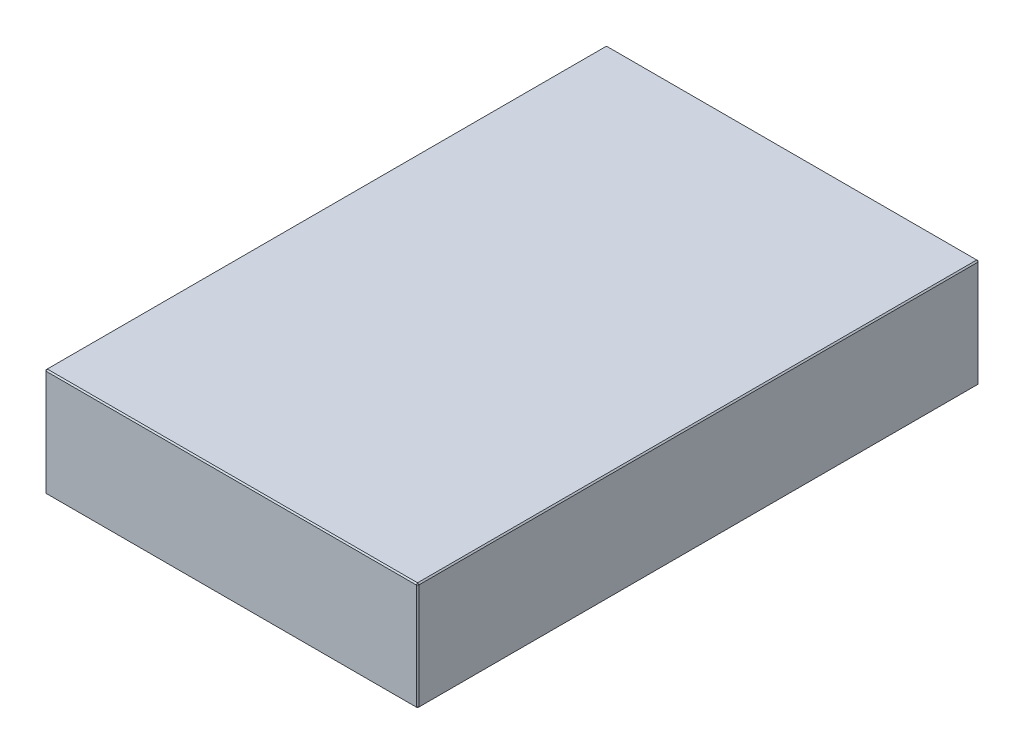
ISO-10303-21;
HEADER;
FILE_DESCRIPTION(('STEP AP214'),'2;1');
FILE_NAME('part.step','',(''),(''),'','','');
FILE_SCHEMA(('AUTOMOTIVE_DESIGN { 1 0 10303 214 1 1 1 1 }'));
ENDSEC;
DATA;
#1=APPLICATION_CONTEXT('core data for automotive mechanical design processes');
#2=APPLICATION_PROTOCOL_DEFINITION('international standard','automotive_design',2000,#1);
#3=PRODUCT_CONTEXT('',#1,'mechanical');
#4=PRODUCT('Part','Part','',(#3));
#5=PRODUCT_RELATED_PRODUCT_CATEGORY('part','',(#4));
#6=PRODUCT_DEFINITION_FORMATION('','',#4);
#7=PRODUCT_DEFINITION_CONTEXT('part definition',#1,'design');
#8=PRODUCT_DEFINITION('design','',#6,#7);
#9=PRODUCT_DEFINITION_SHAPE('','',#8);
#10=(LENGTH_UNIT() NAMED_UNIT(*) SI_UNIT(.MILLI.,.METRE.));
#11=(NAMED_UNIT(*) PLANE_ANGLE_UNIT() SI_UNIT($,.RADIAN.));
#12=(NAMED_UNIT(*) SI_UNIT($,.STERADIAN.) SOLID_ANGLE_UNIT());
#13=UNCERTAINTY_MEASURE_WITH_UNIT(LENGTH_MEASURE(1.E-05),#10,'distance_accuracy_value','');
#14=(GEOMETRIC_REPRESENTATION_CONTEXT(3) GLOBAL_UNCERTAINTY_ASSIGNED_CONTEXT((#13)) GLOBAL_UNIT_ASSIGNED_CONTEXT((#10,
#11,#12)) REPRESENTATION_CONTEXT('',''));
#15=CARTESIAN_POINT('',(0.,0.,0.));
#16=DIRECTION('',(0.,0.,1.));
#17=DIRECTION('',(1.,0.,0.));
#18=AXIS2_PLACEMENT_3D('',#15,#16,#17);
#19=CARTESIAN_POINT('',(-148.,86.,223.));
#20=DIRECTION('',(1.,0.,0.));
#21=DIRECTION('',(0.,0.,-1.));
#22=AXIS2_PLACEMENT_3D('',#19,#20,#21);
#23=PLANE('',#22);
#24=DIRECTION('',(0.,-1.,0.));
#25=VECTOR('',#24,1.);
#26=CARTESIAN_POINT('',(-148.,86.,-222.));
#27=LINE('',#26,#25);
#28=CARTESIAN_POINT('',(-148.,85.,-222.));
#29=VERTEX_POINT('',#28);
#30=CARTESIAN_POINT('',(-148.,1.,-222.));
#31=VERTEX_POINT('',#30);
#32=EDGE_CURVE('E114',#29,#31,#27,.T.);
#33=ORIENTED_EDGE('',*,*,#32,.T.);
#34=DIRECTION('',(0.,0.,1.));
#35=VECTOR('',#34,1.);
#36=CARTESIAN_POINT('',(-148.,1.,223.));
#37=LINE('',#36,#35);
#38=CARTESIAN_POINT('',(-148.,1.,222.));
#39=VERTEX_POINT('',#38);
#40=EDGE_CURVE('E110',#31,#39,#37,.T.);
#41=ORIENTED_EDGE('',*,*,#40,.T.);
#42=DIRECTION('',(0.,1.,0.));
#43=VECTOR('',#42,1.);
#44=CARTESIAN_POINT('',(-148.,86.,222.));
#45=LINE('',#44,#43);
#46=CARTESIAN_POINT('',(-148.,85.,222.));
#47=VERTEX_POINT('',#46);
#48=EDGE_CURVE('E103',#39,#47,#45,.T.);
#49=ORIENTED_EDGE('',*,*,#48,.T.);
#50=DIRECTION('',(0.,0.,-1.));
#51=VECTOR('',#50,1.);
#52=CARTESIAN_POINT('',(-148.,85.,-223.));
#53=LINE('',#52,#51);
#54=EDGE_CURVE('E107',#47,#29,#53,.T.);
#55=ORIENTED_EDGE('',*,*,#54,.T.);
#56=EDGE_LOOP('',(#33,#41,#49,#55));
#57=FACE_BOUND('',#56,.T.);
#58=ADVANCED_FACE('F15',(#57),#23,.F.);
#59=CARTESIAN_POINT('',(148.,86.,223.));
#60=DIRECTION('',(0.,0.,-1.));
#61=DIRECTION('',(-1.,0.,0.));
#62=AXIS2_PLACEMENT_3D('',#59,#60,#61);
#63=PLANE('',#62);
#64=DIRECTION('',(-1.,0.,0.));
#65=VECTOR('',#64,1.);
#66=CARTESIAN_POINT('',(-148.,85.,223.));
#67=LINE('',#66,#65);
#68=CARTESIAN_POINT('',(147.,85.,223.));
#69=VERTEX_POINT('',#68);
#70=CARTESIAN_POINT('',(-147.,85.,223.));
#71=VERTEX_POINT('',#70);
#72=EDGE_CURVE('E164',#69,#71,#67,.T.);
#73=ORIENTED_EDGE('',*,*,#72,.T.);
#74=DIRECTION('',(0.,-1.,0.));
#75=VECTOR('',#74,1.);
#76=CARTESIAN_POINT('',(-147.,86.,223.));
#77=LINE('',#76,#75);
#78=CARTESIAN_POINT('',(-147.,1.,223.));
#79=VERTEX_POINT('',#78);
#80=EDGE_CURVE('E122',#71,#79,#77,.T.);
#81=ORIENTED_EDGE('',*,*,#80,.T.);
#82=DIRECTION('',(1.,0.,0.));
#83=VECTOR('',#82,1.);
#84=CARTESIAN_POINT('',(148.,1.,223.));
#85=LINE('',#84,#83);
#86=CARTESIAN_POINT('',(147.,1.,223.));
#87=VERTEX_POINT('',#86);
#88=EDGE_CURVE('E168',#79,#87,#85,.T.);
#89=ORIENTED_EDGE('',*,*,#88,.T.);
#90=DIRECTION('',(0.,1.,0.));
#91=VECTOR('',#90,1.);
#92=CARTESIAN_POINT('',(147.,86.,223.));
#93=LINE('',#92,#91);
#94=EDGE_CURVE('E166',#87,#69,#93,.T.);
#95=ORIENTED_EDGE('',*,*,#94,.T.);
#96=EDGE_LOOP('',(#73,#81,#89,#95));
#97=FACE_BOUND('',#96,.T.);
#98=ADVANCED_FACE('F275',(#97),#63,.F.);
#99=CARTESIAN_POINT('',(148.,86.,223.));
#100=DIRECTION('',(-1.,0.,0.));
#101=DIRECTION('',(0.,0.,1.));
#102=AXIS2_PLACEMENT_3D('',#99,#100,#101);
#103=PLANE('',#102);
#104=DIRECTION('',(0.,0.,-1.));
#105=VECTOR('',#104,1.);
#106=CARTESIAN_POINT('',(148.,1.,223.));
#107=LINE('',#106,#105);
#108=CARTESIAN_POINT('',(148.,1.,222.));
#109=VERTEX_POINT('',#108);
#110=CARTESIAN_POINT('',(148.,1.,-222.));
#111=VERTEX_POINT('',#110);
#112=EDGE_CURVE('E159',#109,#111,#107,.T.);
#113=ORIENTED_EDGE('',*,*,#112,.T.);
#114=DIRECTION('',(0.,1.,0.));
#115=VECTOR('',#114,1.);
#116=CARTESIAN_POINT('',(148.,86.,-222.));
#117=LINE('',#116,#115);
#118=CARTESIAN_POINT('',(148.,85.,-222.));
#119=VERTEX_POINT('',#118);
#120=EDGE_CURVE('E161',#111,#119,#117,.T.);
#121=ORIENTED_EDGE('',*,*,#120,.T.);
#122=DIRECTION('',(0.,0.,1.));
#123=VECTOR('',#122,1.);
#124=CARTESIAN_POINT('',(148.,85.,223.));
#125=LINE('',#124,#123);
#126=CARTESIAN_POINT('',(148.,85.,222.));
#127=VERTEX_POINT('',#126);
#128=EDGE_CURVE('E155',#119,#127,#125,.T.);
#129=ORIENTED_EDGE('',*,*,#128,.T.);
#130=DIRECTION('',(0.,-1.,0.));
#131=VECTOR('',#130,1.);
#132=CARTESIAN_POINT('',(148.,86.,222.));
#133=LINE('',#132,#131);
#134=EDGE_CURVE('E157',#127,#109,#133,.T.);
#135=ORIENTED_EDGE('',*,*,#134,.T.);
#136=EDGE_LOOP('',(#113,#121,#129,#135));
#137=FACE_BOUND('',#136,.T.);
#138=ADVANCED_FACE('F254',(#137),#103,.F.);
#139=CARTESIAN_POINT('',(148.,86.,-223.));
#140=DIRECTION('',(0.,0.,1.));
#141=DIRECTION('',(1.,0.,0.));
#142=AXIS2_PLACEMENT_3D('',#139,#140,#141);
#143=PLANE('',#142);
#144=DIRECTION('',(0.,-1.,0.));
#145=VECTOR('',#144,1.);
#146=CARTESIAN_POINT('',(147.,86.,-223.));
#147=LINE('',#146,#145);
#148=CARTESIAN_POINT('',(147.,85.,-223.));
#149=VERTEX_POINT('',#148);
#150=CARTESIAN_POINT('',(147.,1.,-223.));
#151=VERTEX_POINT('',#150);
#152=EDGE_CURVE('E148',#149,#151,#147,.T.);
#153=ORIENTED_EDGE('',*,*,#152,.T.);
#154=DIRECTION('',(-1.,0.,0.));
#155=VECTOR('',#154,1.);
#156=CARTESIAN_POINT('',(148.,1.,-223.));
#157=LINE('',#156,#155);
#158=CARTESIAN_POINT('',(-147.,1.,-223.));
#159=VERTEX_POINT('',#158);
#160=EDGE_CURVE('E153',#151,#159,#157,.T.);
#161=ORIENTED_EDGE('',*,*,#160,.T.);
#162=DIRECTION('',(0.,1.,0.));
#163=VECTOR('',#162,1.);
#164=CARTESIAN_POINT('',(-147.,86.,-223.));
#165=LINE('',#164,#163);
#166=CARTESIAN_POINT('',(-147.,85.,-223.));
#167=VERTEX_POINT('',#166);
#168=EDGE_CURVE('E150',#159,#167,#165,.T.);
#169=ORIENTED_EDGE('',*,*,#168,.T.);
#170=DIRECTION('',(1.,0.,0.));
#171=VECTOR('',#170,1.);
#172=CARTESIAN_POINT('',(148.,85.,-223.));
#173=LINE('',#172,#171);
#174=EDGE_CURVE('E146',#167,#149,#173,.T.);
#175=ORIENTED_EDGE('',*,*,#174,.T.);
#176=EDGE_LOOP('',(#153,#161,#169,#175));
#177=FACE_BOUND('',#176,.T.);
#178=ADVANCED_FACE('F284',(#177),#143,.F.);
#179=CARTESIAN_POINT('',(0.,86.,0.));
#180=DIRECTION('',(0.,1.,0.));
#181=DIRECTION('',(0.,0.,1.));
#182=AXIS2_PLACEMENT_3D('',#179,#180,#181);
#183=PLANE('',#182);
#184=DIRECTION('',(0.,0.,-1.));
#185=VECTOR('',#184,1.);
#186=CARTESIAN_POINT('',(147.,86.,-223.));
#187=LINE('',#186,#185);
#188=CARTESIAN_POINT('',(147.,86.,222.));
#189=VERTEX_POINT('',#188);
#190=CARTESIAN_POINT('',(147.,86.,-222.));
#191=VERTEX_POINT('',#190);
#192=EDGE_CURVE('E24',#189,#191,#187,.T.);
#193=ORIENTED_EDGE('',*,*,#192,.T.);
#194=DIRECTION('',(-1.,0.,0.));
#195=VECTOR('',#194,1.);
#196=CARTESIAN_POINT('',(-148.,86.,-222.));
#197=LINE('',#196,#195);
#198=CARTESIAN_POINT('',(-147.,86.,-222.));
#199=VERTEX_POINT('',#198);
#200=EDGE_CURVE('E9',#191,#199,#197,.T.);
#201=ORIENTED_EDGE('',*,*,#200,.T.);
#202=DIRECTION('',(0.,0.,1.));
#203=VECTOR('',#202,1.);
#204=CARTESIAN_POINT('',(-147.,86.,223.));
#205=LINE('',#204,#203);
#206=CARTESIAN_POINT('',(-147.,86.,222.));
#207=VERTEX_POINT('',#206);
#208=EDGE_CURVE('E180',#199,#207,#205,.T.);
#209=ORIENTED_EDGE('',*,*,#208,.T.);
#210=DIRECTION('',(1.,0.,0.));
#211=VECTOR('',#210,1.);
#212=CARTESIAN_POINT('',(148.,86.,222.));
#213=LINE('',#212,#211);
#214=EDGE_CURVE('E35',#207,#189,#213,.T.);
#215=ORIENTED_EDGE('',*,*,#214,.T.);
#216=EDGE_LOOP('',(#193,#201,#209,#215));
#217=FACE_BOUND('',#216,.T.);
#218=ADVANCED_FACE('F350',(#217),#183,.T.);
#219=CARTESIAN_POINT('',(0.,0.,0.));
#220=DIRECTION('',(0.,1.,0.));
#221=DIRECTION('',(0.,0.,1.));
#222=AXIS2_PLACEMENT_3D('',#219,#220,#221);
#223=PLANE('',#222);
#224=DIRECTION('',(0.,0.,1.));
#225=VECTOR('',#224,1.);
#226=CARTESIAN_POINT('',(147.,0.,0.));
#227=LINE('',#226,#225);
#228=CARTESIAN_POINT('',(147.,0.,-222.));
#229=VERTEX_POINT('',#228);
#230=CARTESIAN_POINT('',(147.,0.,222.));
#231=VERTEX_POINT('',#230);
#232=EDGE_CURVE('E171',#229,#231,#227,.T.);
#233=ORIENTED_EDGE('',*,*,#232,.T.);
#234=DIRECTION('',(-1.,0.,0.));
#235=VECTOR('',#234,1.);
#236=CARTESIAN_POINT('',(0.,0.,222.));
#237=LINE('',#236,#235);
#238=CARTESIAN_POINT('',(-147.,0.,222.));
#239=VERTEX_POINT('',#238);
#240=EDGE_CURVE('E177',#231,#239,#237,.T.);
#241=ORIENTED_EDGE('',*,*,#240,.T.);
#242=DIRECTION('',(0.,0.,-1.));
#243=VECTOR('',#242,1.);
#244=CARTESIAN_POINT('',(-147.,0.,0.));
#245=LINE('',#244,#243);
#246=CARTESIAN_POINT('',(-147.,0.,-222.));
#247=VERTEX_POINT('',#246);
#248=EDGE_CURVE('E175',#239,#247,#245,.T.);
#249=ORIENTED_EDGE('',*,*,#248,.T.);
#250=DIRECTION('',(1.,0.,0.));
#251=VECTOR('',#250,1.);
#252=CARTESIAN_POINT('',(0.,0.,-222.));
#253=LINE('',#252,#251);
#254=EDGE_CURVE('E173',#247,#229,#253,.T.);
#255=ORIENTED_EDGE('',*,*,#254,.T.);
#256=EDGE_LOOP('',(#233,#241,#249,#255));
#257=FACE_BOUND('',#256,.T.);
#258=ADVANCED_FACE('F246',(#257),#223,.F.);
#259=CARTESIAN_POINT('',(148.,86.,222.));
#260=DIRECTION('',(-0.707106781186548,0.,-0.707106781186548));
#261=DIRECTION('',(0.,-1.,0.));
#262=AXIS2_PLACEMENT_3D('',#259,#260,#261);
#263=PLANE('',#262);
#264=DIRECTION('',(-0.707106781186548,0.,0.707106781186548));
#265=VECTOR('',#264,1.);
#266=CARTESIAN_POINT('',(147.,85.,223.));
#267=LINE('',#266,#265);
#268=EDGE_CURVE('E19',#69,#127,#267,.F.);
#269=ORIENTED_EDGE('',*,*,#268,.F.);
#270=ORIENTED_EDGE('',*,*,#94,.F.);
#271=DIRECTION('',(0.707106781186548,0.,-0.707106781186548));
#272=VECTOR('',#271,1.);
#273=CARTESIAN_POINT('',(147.,1.,223.));
#274=LINE('',#273,#272);
#275=EDGE_CURVE('E142',#109,#87,#274,.F.);
#276=ORIENTED_EDGE('',*,*,#275,.F.);
#277=ORIENTED_EDGE('',*,*,#134,.F.);
#278=EDGE_LOOP('',(#269,#270,#276,#277));
#279=FACE_BOUND('',#278,.T.);
#280=ADVANCED_FACE('F17',(#279),#263,.F.);
#281=CARTESIAN_POINT('',(147.,85.,223.));
#282=DIRECTION('',(0.577350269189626,0.577350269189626,0.577350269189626));
#283=DIRECTION('',(0.707106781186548,0.,-0.707106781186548));
#284=AXIS2_PLACEMENT_3D('',#281,#282,#283);
#285=PLANE('',#284);
#286=DIRECTION('',(0.,-0.707106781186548,0.707106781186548));
#287=VECTOR('',#286,1.);
#288=CARTESIAN_POINT('',(147.,85.,223.));
#289=LINE('',#288,#287);
#290=EDGE_CURVE('E226',#69,#189,#289,.F.);
#291=ORIENTED_EDGE('',*,*,#290,.F.);
#292=ORIENTED_EDGE('',*,*,#268,.T.);
#293=DIRECTION('',(-0.707106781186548,0.707106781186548,0.));
#294=VECTOR('',#293,1.);
#295=CARTESIAN_POINT('',(147.5,85.5,222.));
#296=LINE('',#295,#294);
#297=EDGE_CURVE('E228',#189,#127,#296,.F.);
#298=ORIENTED_EDGE('',*,*,#297,.F.);
#299=EDGE_LOOP('',(#291,#292,#298));
#300=FACE_BOUND('',#299,.T.);
#301=ADVANCED_FACE('F270',(#300),#285,.T.);
#302=CARTESIAN_POINT('',(147.,1.,223.));
#303=DIRECTION('',(0.577350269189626,-0.577350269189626,0.577350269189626));
#304=DIRECTION('',(0.707106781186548,0.,-0.707106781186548));
#305=AXIS2_PLACEMENT_3D('',#302,#303,#304);
#306=PLANE('',#305);
#307=DIRECTION('',(-0.707106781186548,-0.707106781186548,0.));
#308=VECTOR('',#307,1.);
#309=CARTESIAN_POINT('',(147.5,0.5,222.));
#310=LINE('',#309,#308);
#311=EDGE_CURVE('E220',#109,#231,#310,.T.);
#312=ORIENTED_EDGE('',*,*,#311,.F.);
#313=ORIENTED_EDGE('',*,*,#275,.T.);
#314=DIRECTION('',(0.,0.707106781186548,0.707106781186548));
#315=VECTOR('',#314,1.);
#316=CARTESIAN_POINT('',(147.,1.,223.));
#317=LINE('',#316,#315);
#318=EDGE_CURVE('E223',#231,#87,#317,.T.);
#319=ORIENTED_EDGE('',*,*,#318,.F.);
#320=EDGE_LOOP('',(#312,#313,#319));
#321=FACE_BOUND('',#320,.T.);
#322=ADVANCED_FACE('F235',(#321),#306,.T.);
#323=CARTESIAN_POINT('',(147.,86.,0.));
#324=DIRECTION('',(0.707106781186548,0.707106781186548,0.));
#325=DIRECTION('',(0.,0.,1.));
#326=AXIS2_PLACEMENT_3D('',#323,#324,#325);
#327=PLANE('',#326);
#328=ORIENTED_EDGE('',*,*,#297,.T.);
#329=ORIENTED_EDGE('',*,*,#128,.F.);
#330=DIRECTION('',(0.707106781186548,-0.707106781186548,0.));
#331=VECTOR('',#330,1.);
#332=CARTESIAN_POINT('',(148.,85.,-222.));
#333=LINE('',#332,#331);
#334=EDGE_CURVE('E215',#191,#119,#333,.T.);
#335=ORIENTED_EDGE('',*,*,#334,.F.);
#336=ORIENTED_EDGE('',*,*,#192,.F.);
#337=EDGE_LOOP('',(#328,#329,#335,#336));
#338=FACE_BOUND('',#337,.T.);
#339=ADVANCED_FACE('F265',(#338),#327,.T.);
#340=CARTESIAN_POINT('',(0.,86.,222.));
#341=DIRECTION('',(0.,0.707106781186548,0.707106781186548));
#342=DIRECTION('',(-1.,0.,0.));
#343=AXIS2_PLACEMENT_3D('',#340,#341,#342);
#344=PLANE('',#343);
#345=ORIENTED_EDGE('',*,*,#290,.T.);
#346=ORIENTED_EDGE('',*,*,#214,.F.);
#347=DIRECTION('',(0.,0.707106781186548,-0.707106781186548));
#348=VECTOR('',#347,1.);
#349=CARTESIAN_POINT('',(-147.,85.5,222.5));
#350=LINE('',#349,#348);
#351=EDGE_CURVE('E126',#71,#207,#350,.T.);
#352=ORIENTED_EDGE('',*,*,#351,.F.);
#353=ORIENTED_EDGE('',*,*,#72,.F.);
#354=EDGE_LOOP('',(#345,#346,#352,#353));
#355=FACE_BOUND('',#354,.T.);
#356=ADVANCED_FACE('F273',(#355),#344,.T.);
#357=CARTESIAN_POINT('',(-147.,86.,223.));
#358=DIRECTION('',(0.707106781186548,0.,-0.707106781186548));
#359=DIRECTION('',(0.,-1.,0.));
#360=AXIS2_PLACEMENT_3D('',#357,#358,#359);
#361=PLANE('',#360);
#362=DIRECTION('',(0.707106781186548,0.,0.707106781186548));
#363=VECTOR('',#362,1.);
#364=CARTESIAN_POINT('',(-147.,1.,223.));
#365=LINE('',#364,#363);
#366=EDGE_CURVE('E127',#79,#39,#365,.F.);
#367=ORIENTED_EDGE('',*,*,#366,.F.);
#368=ORIENTED_EDGE('',*,*,#80,.F.);
#369=DIRECTION('',(-0.707106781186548,0.,-0.707106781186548));
#370=VECTOR('',#369,1.);
#371=CARTESIAN_POINT('',(-148.,85.,222.));
#372=LINE('',#371,#370);
#373=EDGE_CURVE('E118',#47,#71,#372,.F.);
#374=ORIENTED_EDGE('',*,*,#373,.F.);
#375=ORIENTED_EDGE('',*,*,#48,.F.);
#376=EDGE_LOOP('',(#367,#368,#374,#375));
#377=FACE_BOUND('',#376,.T.);
#378=ADVANCED_FACE('F120',(#377),#361,.F.);
#379=CARTESIAN_POINT('',(148.,1.,223.));
#380=DIRECTION('',(0.,0.707106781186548,-0.707106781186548));
#381=DIRECTION('',(1.,0.,0.));
#382=AXIS2_PLACEMENT_3D('',#379,#380,#381);
#383=PLANE('',#382);
#384=ORIENTED_EDGE('',*,*,#318,.T.);
#385=ORIENTED_EDGE('',*,*,#88,.F.);
#386=DIRECTION('',(0.,-0.707106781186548,-0.707106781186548));
#387=VECTOR('',#386,1.);
#388=CARTESIAN_POINT('',(-147.,1.,223.));
#389=LINE('',#388,#387);
#390=EDGE_CURVE('E211',#239,#79,#389,.F.);
#391=ORIENTED_EDGE('',*,*,#390,.F.);
#392=ORIENTED_EDGE('',*,*,#240,.F.);
#393=EDGE_LOOP('',(#384,#385,#391,#392));
#394=FACE_BOUND('',#393,.T.);
#395=ADVANCED_FACE('F243',(#394),#383,.F.);
#396=CARTESIAN_POINT('',(148.,1.,223.));
#397=DIRECTION('',(-0.707106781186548,0.707106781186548,0.));
#398=DIRECTION('',(0.,0.,-1.));
#399=AXIS2_PLACEMENT_3D('',#396,#397,#398);
#400=PLANE('',#399);
#401=ORIENTED_EDGE('',*,*,#311,.T.);
#402=ORIENTED_EDGE('',*,*,#232,.F.);
#403=DIRECTION('',(0.707106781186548,0.707106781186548,0.));
#404=VECTOR('',#403,1.);
#405=CARTESIAN_POINT('',(147.5,0.5,-222.));
#406=LINE('',#405,#404);
#407=EDGE_CURVE('E208',#111,#229,#406,.F.);
#408=ORIENTED_EDGE('',*,*,#407,.F.);
#409=ORIENTED_EDGE('',*,*,#112,.F.);
#410=EDGE_LOOP('',(#401,#402,#408,#409));
#411=FACE_BOUND('',#410,.T.);
#412=ADVANCED_FACE('F251',(#411),#400,.F.);
#413=CARTESIAN_POINT('',(147.,86.,-223.));
#414=DIRECTION('',(-0.707106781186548,0.,0.707106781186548));
#415=DIRECTION('',(0.,-1.,0.));
#416=AXIS2_PLACEMENT_3D('',#413,#414,#415);
#417=PLANE('',#416);
#418=DIRECTION('',(0.707106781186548,0.,0.707106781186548));
#419=VECTOR('',#418,1.);
#420=CARTESIAN_POINT('',(148.,85.,-222.));
#421=LINE('',#420,#419);
#422=EDGE_CURVE('E217',#119,#149,#421,.F.);
#423=ORIENTED_EDGE('',*,*,#422,.F.);
#424=ORIENTED_EDGE('',*,*,#120,.F.);
#425=DIRECTION('',(-0.707106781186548,0.,-0.707106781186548));
#426=VECTOR('',#425,1.);
#427=CARTESIAN_POINT('',(147.,1.,-223.));
#428=LINE('',#427,#426);
#429=EDGE_CURVE('E205',#151,#111,#428,.F.);
#430=ORIENTED_EDGE('',*,*,#429,.F.);
#431=ORIENTED_EDGE('',*,*,#152,.F.);
#432=EDGE_LOOP('',(#423,#424,#430,#431));
#433=FACE_BOUND('',#432,.T.);
#434=ADVANCED_FACE('F258',(#433),#417,.F.);
#435=CARTESIAN_POINT('',(148.,85.,-222.));
#436=DIRECTION('',(0.577350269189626,0.577350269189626,-0.577350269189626));
#437=DIRECTION('',(-0.707106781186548,0.,-0.707106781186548));
#438=AXIS2_PLACEMENT_3D('',#435,#436,#437);
#439=PLANE('',#438);
#440=ORIENTED_EDGE('',*,*,#334,.T.);
#441=ORIENTED_EDGE('',*,*,#422,.T.);
#442=DIRECTION('',(0.,0.707106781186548,0.707106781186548));
#443=VECTOR('',#442,1.);
#444=CARTESIAN_POINT('',(147.,85.5,-222.5));
#445=LINE('',#444,#443);
#446=EDGE_CURVE('E134',#191,#149,#445,.F.);
#447=ORIENTED_EDGE('',*,*,#446,.F.);
#448=EDGE_LOOP('',(#440,#441,#447));
#449=FACE_BOUND('',#448,.T.);
#450=ADVANCED_FACE('F325',(#449),#439,.T.);
#451=CARTESIAN_POINT('',(-148.,85.,222.));
#452=DIRECTION('',(-0.577350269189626,0.577350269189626,0.577350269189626));
#453=DIRECTION('',(0.707106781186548,0.,0.707106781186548));
#454=AXIS2_PLACEMENT_3D('',#451,#452,#453);
#455=PLANE('',#454);
#456=ORIENTED_EDGE('',*,*,#373,.T.);
#457=ORIENTED_EDGE('',*,*,#351,.T.);
#458=DIRECTION('',(-0.707106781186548,-0.707106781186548,0.));
#459=VECTOR('',#458,1.);
#460=CARTESIAN_POINT('',(-148.,85.,222.));
#461=LINE('',#460,#459);
#462=EDGE_CURVE('E130',#47,#207,#461,.F.);
#463=ORIENTED_EDGE('',*,*,#462,.F.);
#464=EDGE_LOOP('',(#456,#457,#463));
#465=FACE_BOUND('',#464,.T.);
#466=ADVANCED_FACE('F131',(#465),#455,.T.);
#467=CARTESIAN_POINT('',(-147.,1.,223.));
#468=DIRECTION('',(-0.577350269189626,-0.577350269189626,0.577350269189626));
#469=DIRECTION('',(0.707106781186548,0.,0.707106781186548));
#470=AXIS2_PLACEMENT_3D('',#467,#468,#469);
#471=PLANE('',#470);
#472=ORIENTED_EDGE('',*,*,#390,.T.);
#473=ORIENTED_EDGE('',*,*,#366,.T.);
#474=DIRECTION('',(-0.707106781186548,0.707106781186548,0.));
#475=VECTOR('',#474,1.);
#476=CARTESIAN_POINT('',(-147.5,0.5,222.));
#477=LINE('',#476,#475);
#478=EDGE_CURVE('E135',#239,#39,#477,.T.);
#479=ORIENTED_EDGE('',*,*,#478,.F.);
#480=EDGE_LOOP('',(#472,#473,#479));
#481=FACE_BOUND('',#480,.T.);
#482=ADVANCED_FACE('F318',(#481),#471,.T.);
#483=CARTESIAN_POINT('',(147.,1.,-223.));
#484=DIRECTION('',(0.577350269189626,-0.577350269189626,-0.577350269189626));
#485=DIRECTION('',(-0.707106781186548,0.,-0.707106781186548));
#486=AXIS2_PLACEMENT_3D('',#483,#484,#485);
#487=PLANE('',#486);
#488=ORIENTED_EDGE('',*,*,#429,.T.);
#489=ORIENTED_EDGE('',*,*,#407,.T.);
#490=DIRECTION('',(0.,-0.707106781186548,0.707106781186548));
#491=VECTOR('',#490,1.);
#492=CARTESIAN_POINT('',(147.,1.,-223.));
#493=LINE('',#492,#491);
#494=EDGE_CURVE('E198',#151,#229,#493,.T.);
#495=ORIENTED_EDGE('',*,*,#494,.F.);
#496=EDGE_LOOP('',(#488,#489,#495));
#497=FACE_BOUND('',#496,.T.);
#498=ADVANCED_FACE('F314',(#497),#487,.T.);
#499=CARTESIAN_POINT('',(0.,86.,-222.));
#500=DIRECTION('',(0.,0.707106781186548,-0.707106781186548));
#501=DIRECTION('',(1.,0.,0.));
#502=AXIS2_PLACEMENT_3D('',#499,#500,#501);
#503=PLANE('',#502);
#504=ORIENTED_EDGE('',*,*,#446,.T.);
#505=ORIENTED_EDGE('',*,*,#174,.F.);
#506=DIRECTION('',(0.,-0.707106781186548,-0.707106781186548));
#507=VECTOR('',#506,1.);
#508=CARTESIAN_POINT('',(-147.,85.,-223.));
#509=LINE('',#508,#507);
#510=EDGE_CURVE('E195',#199,#167,#509,.T.);
#511=ORIENTED_EDGE('',*,*,#510,.F.);
#512=ORIENTED_EDGE('',*,*,#200,.F.);
#513=EDGE_LOOP('',(#504,#505,#511,#512));
#514=FACE_BOUND('',#513,.T.);
#515=ADVANCED_FACE('F311',(#514),#503,.T.);
#516=CARTESIAN_POINT('',(-147.,86.,0.));
#517=DIRECTION('',(-0.707106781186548,0.707106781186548,0.));
#518=DIRECTION('',(0.,0.,-1.));
#519=AXIS2_PLACEMENT_3D('',#516,#517,#518);
#520=PLANE('',#519);
#521=ORIENTED_EDGE('',*,*,#462,.T.);
#522=ORIENTED_EDGE('',*,*,#208,.F.);
#523=DIRECTION('',(0.707106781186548,0.707106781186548,0.));
#524=VECTOR('',#523,1.);
#525=CARTESIAN_POINT('',(-147.5,85.5,-222.));
#526=LINE('',#525,#524);
#527=EDGE_CURVE('E138',#29,#199,#526,.T.);
#528=ORIENTED_EDGE('',*,*,#527,.F.);
#529=ORIENTED_EDGE('',*,*,#54,.F.);
#530=EDGE_LOOP('',(#521,#522,#528,#529));
#531=FACE_BOUND('',#530,.T.);
#532=ADVANCED_FACE('F137',(#531),#520,.T.);
#533=CARTESIAN_POINT('',(-148.,1.,223.));
#534=DIRECTION('',(0.707106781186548,0.707106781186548,0.));
#535=DIRECTION('',(0.,0.,1.));
#536=AXIS2_PLACEMENT_3D('',#533,#534,#535);
#537=PLANE('',#536);
#538=ORIENTED_EDGE('',*,*,#478,.T.);
#539=ORIENTED_EDGE('',*,*,#40,.F.);
#540=DIRECTION('',(0.707106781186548,-0.707106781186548,0.));
#541=VECTOR('',#540,1.);
#542=CARTESIAN_POINT('',(-148.,1.,-222.));
#543=LINE('',#542,#541);
#544=EDGE_CURVE('E191',#247,#31,#543,.F.);
#545=ORIENTED_EDGE('',*,*,#544,.F.);
#546=ORIENTED_EDGE('',*,*,#248,.F.);
#547=EDGE_LOOP('',(#538,#539,#545,#546));
#548=FACE_BOUND('',#547,.T.);
#549=ADVANCED_FACE('F304',(#548),#537,.F.);
#550=CARTESIAN_POINT('',(148.,1.,-223.));
#551=DIRECTION('',(0.,0.707106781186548,0.707106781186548));
#552=DIRECTION('',(-1.,0.,0.));
#553=AXIS2_PLACEMENT_3D('',#550,#551,#552);
#554=PLANE('',#553);
#555=ORIENTED_EDGE('',*,*,#494,.T.);
#556=ORIENTED_EDGE('',*,*,#254,.F.);
#557=DIRECTION('',(0.,0.707106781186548,-0.707106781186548));
#558=VECTOR('',#557,1.);
#559=CARTESIAN_POINT('',(-147.,0.5,-222.5));
#560=LINE('',#559,#558);
#561=EDGE_CURVE('E188',#159,#247,#560,.F.);
#562=ORIENTED_EDGE('',*,*,#561,.F.);
#563=ORIENTED_EDGE('',*,*,#160,.F.);
#564=EDGE_LOOP('',(#555,#556,#562,#563));
#565=FACE_BOUND('',#564,.T.);
#566=ADVANCED_FACE('F300',(#565),#554,.F.);
#567=CARTESIAN_POINT('',(-147.,85.,-223.));
#568=DIRECTION('',(-0.577350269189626,0.577350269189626,-0.577350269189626));
#569=DIRECTION('',(-0.707106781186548,0.,0.707106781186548));
#570=AXIS2_PLACEMENT_3D('',#567,#568,#569);
#571=PLANE('',#570);
#572=ORIENTED_EDGE('',*,*,#527,.T.);
#573=ORIENTED_EDGE('',*,*,#510,.T.);
#574=DIRECTION('',(0.707106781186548,0.,-0.707106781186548));
#575=VECTOR('',#574,1.);
#576=CARTESIAN_POINT('',(-147.,85.,-223.));
#577=LINE('',#576,#575);
#578=EDGE_CURVE('E186',#29,#167,#577,.T.);
#579=ORIENTED_EDGE('',*,*,#578,.F.);
#580=EDGE_LOOP('',(#572,#573,#579));
#581=FACE_BOUND('',#580,.T.);
#582=ADVANCED_FACE('F296',(#581),#571,.T.);
#583=CARTESIAN_POINT('',(-148.,1.,-222.));
#584=DIRECTION('',(-0.577350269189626,-0.577350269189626,-0.577350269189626));
#585=DIRECTION('',(-0.707106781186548,0.,0.707106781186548));
#586=AXIS2_PLACEMENT_3D('',#583,#584,#585);
#587=PLANE('',#586);
#588=ORIENTED_EDGE('',*,*,#561,.T.);
#589=ORIENTED_EDGE('',*,*,#544,.T.);
#590=DIRECTION('',(-0.707106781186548,0.,0.707106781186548));
#591=VECTOR('',#590,1.);
#592=CARTESIAN_POINT('',(-148.,1.,-222.));
#593=LINE('',#592,#591);
#594=EDGE_CURVE('E184',#159,#31,#593,.T.);
#595=ORIENTED_EDGE('',*,*,#594,.F.);
#596=EDGE_LOOP('',(#588,#589,#595));
#597=FACE_BOUND('',#596,.T.);
#598=ADVANCED_FACE('F292',(#597),#587,.T.);
#599=CARTESIAN_POINT('',(-148.,86.,-222.));
#600=DIRECTION('',(0.707106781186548,0.,0.707106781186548));
#601=DIRECTION('',(0.,-1.,0.));
#602=AXIS2_PLACEMENT_3D('',#599,#600,#601);
#603=PLANE('',#602);
#604=ORIENTED_EDGE('',*,*,#578,.T.);
#605=ORIENTED_EDGE('',*,*,#168,.F.);
#606=ORIENTED_EDGE('',*,*,#594,.T.);
#607=ORIENTED_EDGE('',*,*,#32,.F.);
#608=EDGE_LOOP('',(#604,#605,#606,#607));
#609=FACE_BOUND('',#608,.T.);
#610=ADVANCED_FACE('F289',(#609),#603,.F.);
#611=CLOSED_SHELL('',(#58,#98,#138,#178,#218,#258,#280,#301,#322,#339,#356,#378,#395,#412,#434,
#450,#466,#482,#498,#515,#532,#549,#566,#582,#598,#610));
#612=MANIFOLD_SOLID_BREP('B1',#611);
#613=ADVANCED_BREP_SHAPE_REPRESENTATION('',(#18,#612),#14);
#614=SHAPE_DEFINITION_REPRESENTATION(#9,#613);
ENDSEC;
END-ISO-10303-21;
